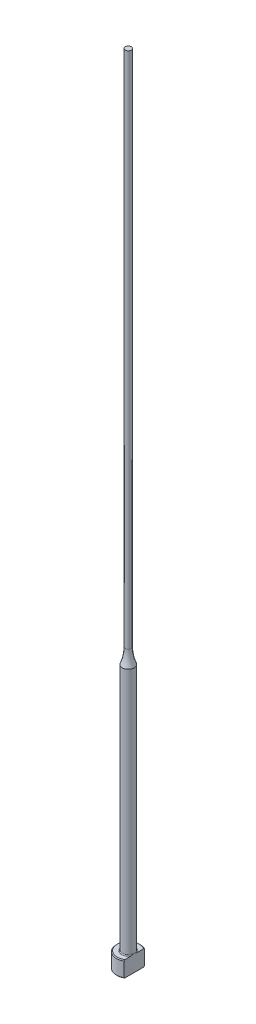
ISO-10303-21;
HEADER;
FILE_DESCRIPTION(('STEP AP214'),'2;1');
FILE_NAME('part.step','',(''),(''),'','','');
FILE_SCHEMA(('AUTOMOTIVE_DESIGN { 1 0 10303 214 1 1 1 1 }'));
ENDSEC;
DATA;
#1=APPLICATION_CONTEXT('core data for automotive mechanical design processes');
#2=APPLICATION_PROTOCOL_DEFINITION('international standard','automotive_design',2000,#1);
#3=PRODUCT_CONTEXT('',#1,'mechanical');
#4=PRODUCT('Part','Part','',(#3));
#5=PRODUCT_RELATED_PRODUCT_CATEGORY('part','',(#4));
#6=PRODUCT_DEFINITION_FORMATION('','',#4);
#7=PRODUCT_DEFINITION_CONTEXT('part definition',#1,'design');
#8=PRODUCT_DEFINITION('design','',#6,#7);
#9=PRODUCT_DEFINITION_SHAPE('','',#8);
#10=(LENGTH_UNIT() NAMED_UNIT(*) SI_UNIT(.MILLI.,.METRE.));
#11=(NAMED_UNIT(*) PLANE_ANGLE_UNIT() SI_UNIT($,.RADIAN.));
#12=(NAMED_UNIT(*) SI_UNIT($,.STERADIAN.) SOLID_ANGLE_UNIT());
#13=UNCERTAINTY_MEASURE_WITH_UNIT(LENGTH_MEASURE(1.E-05),#10,'distance_accuracy_value','');
#14=(GEOMETRIC_REPRESENTATION_CONTEXT(3) GLOBAL_UNCERTAINTY_ASSIGNED_CONTEXT((#13)) GLOBAL_UNIT_ASSIGNED_CONTEXT((#10,
#11,#12)) REPRESENTATION_CONTEXT('',''));
#15=CARTESIAN_POINT('',(0.,0.,0.));
#16=DIRECTION('',(0.,0.,1.));
#17=DIRECTION('',(1.,0.,0.));
#18=AXIS2_PLACEMENT_3D('',#15,#16,#17);
#19=CARTESIAN_POINT('',(-2.99999999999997,4.,0.));
#20=DIRECTION('',(0.,1.,0.));
#21=DIRECTION('',(0.,0.,1.));
#22=AXIS2_PLACEMENT_3D('',#19,#20,#21);
#23=PLANE('',#22);
#24=CARTESIAN_POINT('',(0.,4.,0.));
#25=DIRECTION('',(0.,1.,0.));
#26=DIRECTION('',(0.,0.,1.));
#27=AXIS2_PLACEMENT_3D('',#24,#25,#26);
#28=CIRCLE('',#27,2.79999999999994);
#29=CARTESIAN_POINT('',(1.49999999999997,4.,-2.36431808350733));
#30=VERTEX_POINT('',#29);
#31=CARTESIAN_POINT('',(1.49999999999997,4.,2.36431808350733));
#32=VERTEX_POINT('',#31);
#33=EDGE_CURVE('E187',#30,#32,#28,.T.);
#34=ORIENTED_EDGE('',*,*,#33,.T.);
#35=DIRECTION('',(0.,0.,-1.));
#36=VECTOR('',#35,1.);
#37=CARTESIAN_POINT('',(1.49999999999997,4.,0.));
#38=LINE('',#37,#36);
#39=CARTESIAN_POINT('',(1.49999999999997,3.99999999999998,0.799999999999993));
#40=VERTEX_POINT('',#39);
#41=EDGE_CURVE('E57',#32,#40,#38,.T.);
#42=ORIENTED_EDGE('',*,*,#41,.T.);
#43=CARTESIAN_POINT('',(0.,4.,0.));
#44=DIRECTION('',(0.,1.,0.));
#45=DIRECTION('',(0.,0.,1.));
#46=AXIS2_PLACEMENT_3D('',#43,#44,#45);
#47=CIRCLE('',#46,1.69999999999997);
#48=CARTESIAN_POINT('',(1.49999999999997,3.99999999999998,-0.799999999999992));
#49=VERTEX_POINT('',#48);
#50=EDGE_CURVE('E108',#40,#49,#47,.F.);
#51=ORIENTED_EDGE('',*,*,#50,.T.);
#52=EDGE_CURVE('E137',#49,#30,#38,.T.);
#53=ORIENTED_EDGE('',*,*,#52,.T.);
#54=EDGE_LOOP('',(#34,#42,#51,#53));
#55=FACE_BOUND('',#54,.T.);
#56=ADVANCED_FACE('F32',(#55),#23,.T.);
#57=CARTESIAN_POINT('',(0.,259.958771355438,0.));
#58=DIRECTION('',(0.,1.,0.));
#59=DIRECTION('',(0.,0.,1.));
#60=AXIS2_PLACEMENT_3D('',#57,#58,#59);
#61=CYLINDRICAL_SURFACE('',#60,2.99999999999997);
#62=CARTESIAN_POINT('',(0.,3.79999999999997,0.));
#63=DIRECTION('',(0.,1.,0.));
#64=DIRECTION('',(0.,0.,1.));
#65=AXIS2_PLACEMENT_3D('',#62,#63,#64);
#66=CIRCLE('',#65,2.99999999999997);
#67=CARTESIAN_POINT('',(1.49999999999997,3.79999999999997,2.5980762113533));
#68=VERTEX_POINT('',#67);
#69=CARTESIAN_POINT('',(1.49999999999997,3.79999999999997,-2.5980762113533));
#70=VERTEX_POINT('',#69);
#71=EDGE_CURVE('E105',#68,#70,#66,.F.);
#72=ORIENTED_EDGE('',*,*,#71,.T.);
#73=DIRECTION('',(0.,-1.,0.));
#74=VECTOR('',#73,1.);
#75=CARTESIAN_POINT('',(1.49999999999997,200.,-2.5980762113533));
#76=LINE('',#75,#74);
#77=CARTESIAN_POINT('',(1.49999999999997,0.200000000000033,-2.5980762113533));
#78=VERTEX_POINT('',#77);
#79=EDGE_CURVE('E193',#70,#78,#76,.T.);
#80=ORIENTED_EDGE('',*,*,#79,.T.);
#81=CARTESIAN_POINT('',(0.,0.200000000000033,0.));
#82=DIRECTION('',(0.,-1.,0.));
#83=DIRECTION('',(0.,0.,-1.));
#84=AXIS2_PLACEMENT_3D('',#81,#82,#83);
#85=CIRCLE('',#84,2.99999999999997);
#86=CARTESIAN_POINT('',(1.49999999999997,0.200000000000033,2.5980762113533));
#87=VERTEX_POINT('',#86);
#88=EDGE_CURVE('E100',#78,#87,#85,.F.);
#89=ORIENTED_EDGE('',*,*,#88,.T.);
#90=DIRECTION('',(0.,-1.,0.));
#91=VECTOR('',#90,1.);
#92=CARTESIAN_POINT('',(1.49999999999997,200.,2.5980762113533));
#93=LINE('',#92,#91);
#94=EDGE_CURVE('E93',#68,#87,#93,.T.);
#95=ORIENTED_EDGE('',*,*,#94,.F.);
#96=EDGE_LOOP('',(#72,#80,#89,#95));
#97=FACE_BOUND('',#96,.T.);
#98=ADVANCED_FACE('F158',(#97),#61,.T.);
#99=CARTESIAN_POINT('',(0.,0.,0.));
#100=DIRECTION('',(0.,-1.,0.));
#101=DIRECTION('',(0.,0.,-1.));
#102=AXIS2_PLACEMENT_3D('',#99,#100,#101);
#103=PLANE('',#102);
#104=CARTESIAN_POINT('',(0.,0.,0.));
#105=DIRECTION('',(0.,-1.,0.));
#106=DIRECTION('',(0.,0.,-1.));
#107=AXIS2_PLACEMENT_3D('',#104,#105,#106);
#108=CIRCLE('',#107,2.79999999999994);
#109=CARTESIAN_POINT('',(1.49999999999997,0.,2.36431808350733));
#110=VERTEX_POINT('',#109);
#111=CARTESIAN_POINT('',(1.49999999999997,0.,-2.36431808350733));
#112=VERTEX_POINT('',#111);
#113=EDGE_CURVE('E98',#110,#112,#108,.T.);
#114=ORIENTED_EDGE('',*,*,#113,.T.);
#115=DIRECTION('',(0.,0.,1.));
#116=VECTOR('',#115,1.);
#117=CARTESIAN_POINT('',(1.49999999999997,0.,2.5980762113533));
#118=LINE('',#117,#116);
#119=EDGE_CURVE('E83',#112,#110,#118,.T.);
#120=ORIENTED_EDGE('',*,*,#119,.T.);
#121=EDGE_LOOP('',(#114,#120));
#122=FACE_BOUND('',#121,.T.);
#123=ADVANCED_FACE('F103',(#122),#103,.T.);
#124=CARTESIAN_POINT('',(0.,4.,0.));
#125=DIRECTION('',(0.,-1.,0.));
#126=DIRECTION('',(0.,0.,-1.));
#127=AXIS2_PLACEMENT_3D('',#124,#125,#126);
#128=CONICAL_SURFACE('',#127,2.79999999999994,0.785398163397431);
#129=ORIENTED_EDGE('',*,*,#71,.F.);
#130=CARTESIAN_POINT('',(1.49999999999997,0.888258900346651,5.71827621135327));
#131=CARTESIAN_POINT('',(1.49999999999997,1.01361833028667,5.58866816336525));
#132=CARTESIAN_POINT('',(1.49999999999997,1.13884324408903,5.45892957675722));
#133=CARTESIAN_POINT('',(1.49999999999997,1.38894444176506,5.19911365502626));
#134=CARTESIAN_POINT('',(1.49999999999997,1.51382072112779,5.06903631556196));
#135=CARTESIAN_POINT('',(1.49999999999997,1.76320568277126,4.80840180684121));
#136=CARTESIAN_POINT('',(1.49999999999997,1.88771414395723,4.67784442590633));
#137=CARTESIAN_POINT('',(1.49999999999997,2.13618059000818,4.4162081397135));
#138=CARTESIAN_POINT('',(1.49999999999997,2.26013857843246,4.28512923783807));
#139=CARTESIAN_POINT('',(1.49999999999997,2.50488975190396,4.02490837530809));
#140=CARTESIAN_POINT('',(1.49999999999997,2.62569693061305,3.8957795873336));
#141=CARTESIAN_POINT('',(1.49999999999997,2.86640694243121,3.63668213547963));
#142=CARTESIAN_POINT('',(1.49999999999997,2.98630978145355,3.50671347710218));
#143=CARTESIAN_POINT('',(1.49999999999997,3.22486033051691,3.24567921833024));
#144=CARTESIAN_POINT('',(1.49999999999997,3.3435083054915,3.11461386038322));
#145=CARTESIAN_POINT('',(1.49999999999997,3.5790771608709,2.85094268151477));
#146=CARTESIAN_POINT('',(1.49999999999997,3.69599811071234,2.71833692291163));
#147=CARTESIAN_POINT('',(1.49999999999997,3.88262371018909,2.50255231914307));
#148=CARTESIAN_POINT('',(1.49999999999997,3.95312454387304,2.42006293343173));
#149=CARTESIAN_POINT('',(1.49999999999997,4.09287098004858,2.254010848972));
#150=CARTESIAN_POINT('',(1.49999999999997,4.16211645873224,2.17044804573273));
#151=CARTESIAN_POINT('',(1.49999999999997,4.29964684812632,2.00105967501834));
#152=CARTESIAN_POINT('',(1.49999999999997,4.36791386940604,1.9152195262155));
#153=CARTESIAN_POINT('',(1.49999999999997,4.50205840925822,1.7417139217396));
#154=CARTESIAN_POINT('',(1.49999999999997,4.56793649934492,1.65404891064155));
#155=CARTESIAN_POINT('',(1.49999999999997,4.69728151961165,1.47490236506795));
#156=CARTESIAN_POINT('',(1.49999999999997,4.76069661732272,1.38338308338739));
#157=CARTESIAN_POINT('',(1.49999999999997,4.88239539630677,1.19675661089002));
#158=CARTESIAN_POINT('',(1.49999999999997,4.94067201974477,1.10164473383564));
#159=CARTESIAN_POINT('',(1.49999999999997,5.048413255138,0.908008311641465));
#160=CARTESIAN_POINT('',(1.49999999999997,5.09797809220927,0.809540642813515));
#161=CARTESIAN_POINT('',(1.49999999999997,5.18432188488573,0.607192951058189));
#162=CARTESIAN_POINT('',(1.49999999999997,5.22114374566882,0.50333247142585));
#163=CARTESIAN_POINT('',(1.49999999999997,5.26099935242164,0.347577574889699));
#164=CARTESIAN_POINT('',(1.49999999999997,5.2715702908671,0.297609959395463));
#165=CARTESIAN_POINT('',(1.49999999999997,5.28794860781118,0.196885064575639));
#166=CARTESIAN_POINT('',(1.49999999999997,5.29375640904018,0.146127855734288));
#167=CARTESIAN_POINT('',(1.49999999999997,5.30019707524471,0.0444388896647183));
#168=CARTESIAN_POINT('',(1.49999999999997,5.30084594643,-0.00649183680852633));
#169=CARTESIAN_POINT('',(1.49999999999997,5.29696416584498,-0.108155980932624));
#170=CARTESIAN_POINT('',(1.49999999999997,5.29243308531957,-0.158889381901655));
#171=CARTESIAN_POINT('',(1.49999999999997,5.27856915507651,-0.259234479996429));
#172=CARTESIAN_POINT('',(1.49999999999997,5.2692782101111,-0.308852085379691));
#173=CARTESIAN_POINT('',(1.49999999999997,5.24647108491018,-0.407110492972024));
#174=CARTESIAN_POINT('',(1.49999999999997,5.23295324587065,-0.45575090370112));
#175=CARTESIAN_POINT('',(1.49999999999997,5.20226175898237,-0.55214996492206));
#176=CARTESIAN_POINT('',(1.49999999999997,5.18506801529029,-0.599902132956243));
#177=CARTESIAN_POINT('',(1.49999999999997,5.1477138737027,-0.694205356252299));
#178=CARTESIAN_POINT('',(1.49999999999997,5.12755408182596,-0.740756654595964));
#179=CARTESIAN_POINT('',(1.49999999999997,5.0632769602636,-0.879166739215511));
#180=CARTESIAN_POINT('',(1.49999999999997,5.01551721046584,-0.969329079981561));
#181=CARTESIAN_POINT('',(1.49999999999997,4.91367909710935,-1.14604316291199));
#182=CARTESIAN_POINT('',(1.49999999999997,4.85959300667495,-1.2325903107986));
#183=CARTESIAN_POINT('',(1.49999999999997,4.74697968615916,-1.40321348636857));
#184=CARTESIAN_POINT('',(1.49999999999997,4.68843573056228,-1.4872783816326));
#185=CARTESIAN_POINT('',(1.49999999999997,4.5684384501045,-1.65322187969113));
#186=CARTESIAN_POINT('',(1.49999999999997,4.50698656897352,-1.73510153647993));
#187=CARTESIAN_POINT('',(1.49999999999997,4.3811567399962,-1.89829823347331));
#188=CARTESIAN_POINT('',(1.49999999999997,4.31675092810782,-1.97959369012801));
#189=CARTESIAN_POINT('',(1.49999999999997,4.18634068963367,-2.14090082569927));
#190=CARTESIAN_POINT('',(1.49999999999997,4.12033609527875,-2.22091236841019));
#191=CARTESIAN_POINT('',(1.49999999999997,3.92086431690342,-2.45906508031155));
#192=CARTESIAN_POINT('',(1.49999999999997,3.78562663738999,-2.61572090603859));
#193=CARTESIAN_POINT('',(1.49999999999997,3.53554498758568,-2.90006295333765));
#194=CARTESIAN_POINT('',(1.49999999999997,3.42114543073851,-3.02814382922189));
#195=CARTESIAN_POINT('',(1.49999999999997,3.1909355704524,-3.28303767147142));
#196=CARTESIAN_POINT('',(1.49999999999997,3.07512522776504,-3.40985060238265));
#197=CARTESIAN_POINT('',(1.49999999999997,2.72597067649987,-3.78913849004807));
#198=CARTESIAN_POINT('',(1.49999999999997,2.49111760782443,-4.04022177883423));
#199=CARTESIAN_POINT('',(1.49999999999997,2.0288247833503,-4.52992803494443));
#200=CARTESIAN_POINT('',(1.49999999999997,1.80147747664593,-4.7686387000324));
#201=CARTESIAN_POINT('',(1.49999999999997,1.45954865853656,-5.12558036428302));
#202=CARTESIAN_POINT('',(1.49999999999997,1.34548484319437,-5.24430773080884));
#203=CARTESIAN_POINT('',(1.49999999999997,1.11707176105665,-5.48148573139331));
#204=CARTESIAN_POINT('',(1.49999999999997,1.00272249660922,-5.59993636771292));
#205=CARTESIAN_POINT('',(1.49999999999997,0.888258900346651,-5.71827621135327));
#206=B_SPLINE_CURVE_WITH_KNOTS('',3,(#130,#131,#132,#133,#134,#135,#136,#137,#138,#139,#140,
#141,#142,#143,#144,#145,#146,#147,#148,#149,#150,#151,#152,#153,#154,#155,#156,#157,#158,#159,
#160,#161,#162,#163,#164,#165,#166,#167,#168,#169,#170,#171,#172,#173,#174,#175,#176,#177,#178,
#179,#180,#181,#182,#183,#184,#185,#186,#187,#188,#189,#190,#191,#192,#193,#194,#195,#196,#197,
#198,#199,#200,#201,#202,#203,#204,#205),.UNSPECIFIED.,.F.,.F.,(4,2,2,2,2,2,2,2,2,2,2,2,2,2,2,2,
2,2,2,2,2,2,2,2,2,2,2,2,2,2,2,2,2,2,2,2,2,4),(0.,0.540943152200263,1.08189327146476,
1.62312052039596,2.16434426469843,2.69482920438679,3.22531067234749,3.75567781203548,
4.28602356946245,4.611550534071,4.9371094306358,5.26610945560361,5.59503024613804,
5.92894782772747,6.26331713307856,6.59354403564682,6.92264800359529,7.07567478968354,
7.22868799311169,7.38122626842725,7.53377717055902,7.68500755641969,7.83629736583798,
7.988436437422,8.14054446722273,8.44618799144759,8.75220879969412,9.05944044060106,
9.36652111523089,9.6776428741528,9.98879742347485,10.609592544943,11.1247803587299,
11.6399825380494,12.6713544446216,13.6603005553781,14.1542238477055,14.6481430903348),.UNSPECIFIED.);
#207=EDGE_CURVE('E136',#68,#32,#206,.T.);
#208=ORIENTED_EDGE('',*,*,#207,.T.);
#209=ORIENTED_EDGE('',*,*,#33,.F.);
#210=EDGE_CURVE('E128',#30,#70,#206,.T.);
#211=ORIENTED_EDGE('',*,*,#210,.T.);
#212=EDGE_LOOP('',(#129,#208,#209,#211));
#213=FACE_BOUND('',#212,.T.);
#214=ADVANCED_FACE('F144',(#213),#128,.T.);
#215=CARTESIAN_POINT('',(0.,0.200000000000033,0.));
#216=DIRECTION('',(0.,1.,0.));
#217=DIRECTION('',(0.,0.,1.));
#218=AXIS2_PLACEMENT_3D('',#215,#216,#217);
#219=CONICAL_SURFACE('',#218,2.99999999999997,0.785398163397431);
#220=ORIENTED_EDGE('',*,*,#88,.F.);
#221=CARTESIAN_POINT('',(1.49999999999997,3.11174109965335,-5.71827621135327));
#222=CARTESIAN_POINT('',(1.49999999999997,2.98638166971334,-5.58866816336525));
#223=CARTESIAN_POINT('',(1.49999999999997,2.86115675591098,-5.45892957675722));
#224=CARTESIAN_POINT('',(1.49999999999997,2.61105555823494,-5.19911365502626));
#225=CARTESIAN_POINT('',(1.49999999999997,2.48617927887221,-5.06903631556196));
#226=CARTESIAN_POINT('',(1.49999999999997,2.23679431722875,-4.80840180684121));
#227=CARTESIAN_POINT('',(1.49999999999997,2.11228585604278,-4.67784442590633));
#228=CARTESIAN_POINT('',(1.49999999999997,1.86381940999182,-4.4162081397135));
#229=CARTESIAN_POINT('',(1.49999999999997,1.73986142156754,-4.28512923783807));
#230=CARTESIAN_POINT('',(1.49999999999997,1.49511024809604,-4.02490837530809));
#231=CARTESIAN_POINT('',(1.49999999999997,1.37430306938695,-3.8957795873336));
#232=CARTESIAN_POINT('',(1.49999999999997,1.13359305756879,-3.63668213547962));
#233=CARTESIAN_POINT('',(1.49999999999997,1.01369021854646,-3.50671347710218));
#234=CARTESIAN_POINT('',(1.49999999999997,0.775139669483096,-3.24567921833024));
#235=CARTESIAN_POINT('',(1.49999999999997,0.656491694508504,-3.11461386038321));
#236=CARTESIAN_POINT('',(1.49999999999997,0.420922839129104,-2.85094268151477));
#237=CARTESIAN_POINT('',(1.49999999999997,0.304001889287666,-2.71833692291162));
#238=CARTESIAN_POINT('',(1.49999999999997,0.117376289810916,-2.50255231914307));
#239=CARTESIAN_POINT('',(1.49999999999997,0.0468754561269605,-2.42006293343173));
#240=CARTESIAN_POINT('',(1.49999999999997,-0.0928709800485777,-2.254010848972));
#241=CARTESIAN_POINT('',(1.49999999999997,-0.162116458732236,-2.17044804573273));
#242=CARTESIAN_POINT('',(1.49999999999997,-0.299646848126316,-2.00105967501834));
#243=CARTESIAN_POINT('',(1.49999999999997,-0.367913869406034,-1.9152195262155));
#244=CARTESIAN_POINT('',(1.49999999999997,-0.502058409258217,-1.7417139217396));
#245=CARTESIAN_POINT('',(1.49999999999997,-0.567936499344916,-1.65404891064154));
#246=CARTESIAN_POINT('',(1.49999999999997,-0.697281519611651,-1.47490236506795));
#247=CARTESIAN_POINT('',(1.49999999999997,-0.760696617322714,-1.38338308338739));
#248=CARTESIAN_POINT('',(1.49999999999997,-0.882395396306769,-1.19675661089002));
#249=CARTESIAN_POINT('',(1.49999999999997,-0.940672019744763,-1.10164473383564));
#250=CARTESIAN_POINT('',(1.49999999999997,-1.048413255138,-0.908008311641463));
#251=CARTESIAN_POINT('',(1.49999999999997,-1.09797809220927,-0.809540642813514));
#252=CARTESIAN_POINT('',(1.49999999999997,-1.18432188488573,-0.607192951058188));
#253=CARTESIAN_POINT('',(1.49999999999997,-1.22114374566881,-0.503332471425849));
#254=CARTESIAN_POINT('',(1.49999999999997,-1.26099935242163,-0.347577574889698));
#255=CARTESIAN_POINT('',(1.49999999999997,-1.2715702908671,-0.297609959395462));
#256=CARTESIAN_POINT('',(1.49999999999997,-1.28794860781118,-0.196885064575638));
#257=CARTESIAN_POINT('',(1.49999999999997,-1.29375640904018,-0.146127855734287));
#258=CARTESIAN_POINT('',(1.49999999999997,-1.30019707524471,-0.0444388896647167));
#259=CARTESIAN_POINT('',(1.49999999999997,-1.30084594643,0.00649183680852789));
#260=CARTESIAN_POINT('',(1.49999999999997,-1.29696416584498,0.108155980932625));
#261=CARTESIAN_POINT('',(1.49999999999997,-1.29243308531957,0.158889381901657));
#262=CARTESIAN_POINT('',(1.49999999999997,-1.2785691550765,0.259234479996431));
#263=CARTESIAN_POINT('',(1.49999999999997,-1.2692782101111,0.308852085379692));
#264=CARTESIAN_POINT('',(1.49999999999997,-1.24647108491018,0.407110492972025));
#265=CARTESIAN_POINT('',(1.49999999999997,-1.23295324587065,0.455750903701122));
#266=CARTESIAN_POINT('',(1.49999999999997,-1.20226175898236,0.552149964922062));
#267=CARTESIAN_POINT('',(1.49999999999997,-1.18506801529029,0.599902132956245));
#268=CARTESIAN_POINT('',(1.49999999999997,-1.14771387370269,0.694205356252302));
#269=CARTESIAN_POINT('',(1.49999999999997,-1.12755408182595,0.740756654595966));
#270=CARTESIAN_POINT('',(1.49999999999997,-1.0632769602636,0.879166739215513));
#271=CARTESIAN_POINT('',(1.49999999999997,-1.01551721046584,0.969329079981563));
#272=CARTESIAN_POINT('',(1.49999999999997,-0.913679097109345,1.14604316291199));
#273=CARTESIAN_POINT('',(1.49999999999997,-0.859593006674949,1.2325903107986));
#274=CARTESIAN_POINT('',(1.49999999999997,-0.746979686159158,1.40321348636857));
#275=CARTESIAN_POINT('',(1.49999999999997,-0.688435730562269,1.4872783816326));
#276=CARTESIAN_POINT('',(1.49999999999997,-0.568438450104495,1.65322187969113));
#277=CARTESIAN_POINT('',(1.49999999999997,-0.506986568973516,1.73510153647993));
#278=CARTESIAN_POINT('',(1.49999999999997,-0.381156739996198,1.89829823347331));
#279=CARTESIAN_POINT('',(1.49999999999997,-0.316750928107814,1.97959369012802));
#280=CARTESIAN_POINT('',(1.49999999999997,-0.186340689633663,2.14090082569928));
#281=CARTESIAN_POINT('',(1.49999999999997,-0.12033609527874,2.22091236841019));
#282=CARTESIAN_POINT('',(1.49999999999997,0.0791356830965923,2.45906508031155));
#283=CARTESIAN_POINT('',(1.49999999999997,0.214373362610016,2.61572090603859));
#284=CARTESIAN_POINT('',(1.49999999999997,0.46445501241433,2.90006295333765));
#285=CARTESIAN_POINT('',(1.49999999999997,0.578854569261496,3.02814382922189));
#286=CARTESIAN_POINT('',(1.49999999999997,0.809064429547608,3.28303767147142));
#287=CARTESIAN_POINT('',(1.49999999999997,0.924874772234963,3.40985060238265));
#288=CARTESIAN_POINT('',(1.49999999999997,1.27402932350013,3.78913849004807));
#289=CARTESIAN_POINT('',(1.49999999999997,1.50888239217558,4.04022177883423));
#290=CARTESIAN_POINT('',(1.49999999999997,1.97117521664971,4.52992803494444));
#291=CARTESIAN_POINT('',(1.49999999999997,2.19852252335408,4.76863870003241));
#292=CARTESIAN_POINT('',(1.49999999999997,2.54045134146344,5.12558036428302));
#293=CARTESIAN_POINT('',(1.49999999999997,2.65451515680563,5.24430773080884));
#294=CARTESIAN_POINT('',(1.49999999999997,2.88292823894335,5.48148573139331));
#295=CARTESIAN_POINT('',(1.49999999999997,2.99727750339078,5.59993636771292));
#296=CARTESIAN_POINT('',(1.49999999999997,3.11174109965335,5.71827621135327));
#297=B_SPLINE_CURVE_WITH_KNOTS('',3,(#221,#222,#223,#224,#225,#226,#227,#228,#229,#230,#231,
#232,#233,#234,#235,#236,#237,#238,#239,#240,#241,#242,#243,#244,#245,#246,#247,#248,#249,#250,
#251,#252,#253,#254,#255,#256,#257,#258,#259,#260,#261,#262,#263,#264,#265,#266,#267,#268,#269,
#270,#271,#272,#273,#274,#275,#276,#277,#278,#279,#280,#281,#282,#283,#284,#285,#286,#287,#288,
#289,#290,#291,#292,#293,#294,#295,#296),.UNSPECIFIED.,.F.,.F.,(4,2,2,2,2,2,2,2,2,2,2,2,2,2,2,2,
2,2,2,2,2,2,2,2,2,2,2,2,2,2,2,2,2,2,2,2,2,4),(0.,0.540943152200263,1.08189327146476,
1.62312052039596,2.16434426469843,2.69482920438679,3.22531067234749,3.75567781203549,
4.28602356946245,4.611550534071,4.9371094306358,5.26610945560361,5.59503024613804,
5.92894782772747,6.26331713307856,6.59354403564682,6.92264800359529,7.07567478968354,
7.2286879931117,7.38122626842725,7.53377717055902,7.6850075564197,7.83629736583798,
7.98843643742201,8.14054446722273,8.44618799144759,8.75220879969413,9.05944044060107,
9.3665211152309,9.6776428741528,9.98879742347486,10.609592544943,11.1247803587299,
11.6399825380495,12.6713544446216,13.6603005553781,14.1542238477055,14.6481430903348),.UNSPECIFIED.);
#298=EDGE_CURVE('E86',#78,#112,#297,.T.);
#299=ORIENTED_EDGE('',*,*,#298,.T.);
#300=ORIENTED_EDGE('',*,*,#113,.F.);
#301=EDGE_CURVE('E89',#110,#87,#297,.T.);
#302=ORIENTED_EDGE('',*,*,#301,.T.);
#303=EDGE_LOOP('',(#220,#299,#300,#302));
#304=FACE_BOUND('',#303,.T.);
#305=ADVANCED_FACE('F97',(#304),#219,.T.);
#306=CARTESIAN_POINT('',(0.,4.19999999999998,0.));
#307=DIRECTION('',(0.,1.,0.));
#308=DIRECTION('',(0.,0.,1.));
#309=AXIS2_PLACEMENT_3D('',#306,#307,#308);
#310=TOROIDAL_SURFACE('',#309,1.69999999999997,0.2);
#311=CARTESIAN_POINT('',(1.49999999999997,4.19999999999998,0.));
#312=CARTESIAN_POINT('',(1.49999999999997,4.20000050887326,7.14686674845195E-11));
#313=CARTESIAN_POINT('',(1.49999999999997,4.20000101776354,-1.21663673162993E-07));
#314=CARTESIAN_POINT('',(1.49999999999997,4.20000199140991,-4.97616237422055E-07));
#315=CARTESIAN_POINT('',(1.49999999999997,4.20000245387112,-7.56516220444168E-07));
#316=CARTESIAN_POINT('',(1.49999999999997,4.20000338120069,-1.37642837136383E-06));
#317=CARTESIAN_POINT('',(1.49999999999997,4.20000384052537,-1.74563476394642E-06));
#318=CARTESIAN_POINT('',(1.49999999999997,4.20000469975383,-2.53565984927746E-06));
#319=CARTESIAN_POINT('',(1.49999999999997,4.20000510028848,-2.95582597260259E-06));
#320=CARTESIAN_POINT('',(1.49999999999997,4.20000646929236,-4.48430445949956E-06));
#321=CARTESIAN_POINT('',(1.49999999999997,4.20000736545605,-5.6586103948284E-06));
#322=CARTESIAN_POINT('',(1.49999999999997,4.20000893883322,-8.06479202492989E-06));
#323=CARTESIAN_POINT('',(1.49999999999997,4.20000962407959,-9.29170517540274E-06));
#324=CARTESIAN_POINT('',(1.49999999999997,4.20001225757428,-1.416232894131E-05));
#325=CARTESIAN_POINT('',(1.49999999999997,4.20001407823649,-1.78790031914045E-05));
#326=CARTESIAN_POINT('',(1.49999999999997,4.20001699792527,-2.51443066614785E-05));
#327=CARTESIAN_POINT('',(1.49999999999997,4.20001815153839,-2.86715394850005E-05));
#328=CARTESIAN_POINT('',(1.49999999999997,4.20002315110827,-4.39218128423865E-05));
#329=CARTESIAN_POINT('',(1.49999999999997,4.20002701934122,-5.56288390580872E-05));
#330=CARTESIAN_POINT('',(1.49999999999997,4.20003312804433,-7.7405829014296E-05));
#331=CARTESIAN_POINT('',(1.49999999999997,4.20003553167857,-8.74278412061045E-05));
#332=CARTESIAN_POINT('',(1.49999999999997,4.20005483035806,-0.000161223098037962));
#333=CARTESIAN_POINT('',(1.49999999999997,4.20007979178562,-0.000222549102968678));
#334=CARTESIAN_POINT('',(1.49999999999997,4.20017391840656,-0.000462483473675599));
#335=CARTESIAN_POINT('',(1.49999999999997,4.20023706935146,-0.000642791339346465));
#336=CARTESIAN_POINT('',(1.49999999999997,4.20048761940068,-0.00134785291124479));
#337=CARTESIAN_POINT('',(1.49999999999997,4.20068132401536,-0.00187087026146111));
#338=CARTESIAN_POINT('',(1.49999999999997,4.20147357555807,-0.00402004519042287));
#339=CARTESIAN_POINT('',(1.49999999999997,4.20206499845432,-0.0056481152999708));
#340=CARTESIAN_POINT('',(1.49999999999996,4.20892634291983,-0.0245232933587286));
#341=CARTESIAN_POINT('',(1.49999999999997,4.21523683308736,-0.041759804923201));
#342=CARTESIAN_POINT('',(1.49999999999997,4.22755028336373,-0.0756091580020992));
#343=CARTESIAN_POINT('',(1.49999999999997,4.23355589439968,-0.0922211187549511));
#344=CARTESIAN_POINT('',(1.49999999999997,4.24620101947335,-0.127454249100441));
#345=CARTESIAN_POINT('',(1.49999999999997,4.25283080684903,-0.146078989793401));
#346=CARTESIAN_POINT('',(1.49999999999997,4.26599765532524,-0.183577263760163));
#347=CARTESIAN_POINT('',(1.49999999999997,4.27253305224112,-0.202451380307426));
#348=CARTESIAN_POINT('',(1.49999999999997,4.28834228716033,-0.248982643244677));
#349=CARTESIAN_POINT('',(1.49999999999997,4.2974915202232,-0.276682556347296));
#350=CARTESIAN_POINT('',(1.49999999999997,4.31490935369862,-0.331625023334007));
#351=CARTESIAN_POINT('',(1.49999999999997,4.3231938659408,-0.358862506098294));
#352=CARTESIAN_POINT('',(1.49999999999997,4.34051594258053,-0.419125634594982));
#353=CARTESIAN_POINT('',(1.49999999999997,4.34936607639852,-0.452206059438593));
#354=CARTESIAN_POINT('',(1.49999999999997,4.36549583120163,-0.519023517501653));
#355=CARTESIAN_POINT('',(1.49999999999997,4.37276283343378,-0.552763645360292));
#356=CARTESIAN_POINT('',(1.49999999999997,4.38554755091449,-0.62305310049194));
#357=CARTESIAN_POINT('',(1.49999999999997,4.39090573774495,-0.65963271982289));
#358=CARTESIAN_POINT('',(1.49999999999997,4.39825016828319,-0.733028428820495));
#359=CARTESIAN_POINT('',(1.49999999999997,4.40024734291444,-0.76984335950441));
#360=CARTESIAN_POINT('',(1.49999999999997,4.39970780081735,-0.842856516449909));
#361=CARTESIAN_POINT('',(1.49999999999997,4.39725347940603,-0.879053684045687));
#362=CARTESIAN_POINT('',(1.49999999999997,4.38900085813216,-0.93238076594));
#363=CARTESIAN_POINT('',(1.49999999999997,4.38553049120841,-0.949868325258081));
#364=CARTESIAN_POINT('',(1.49999999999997,4.37678336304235,-0.984374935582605));
#365=CARTESIAN_POINT('',(1.49999999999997,4.37150943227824,-1.00139467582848));
#366=CARTESIAN_POINT('',(1.49999999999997,4.35869781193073,-1.03479423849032));
#367=CARTESIAN_POINT('',(1.49999999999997,4.3511359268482,-1.05116499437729));
#368=CARTESIAN_POINT('',(1.49999999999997,4.33325333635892,-1.08234828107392));
#369=CARTESIAN_POINT('',(1.49999999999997,4.32294266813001,-1.09716621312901));
#370=CARTESIAN_POINT('',(1.49999999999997,4.30512758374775,-1.11714173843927));
#371=CARTESIAN_POINT('',(1.49999999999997,4.29884721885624,-1.12339066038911));
#372=CARTESIAN_POINT('',(1.49999999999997,4.28545950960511,-1.13494695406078));
#373=CARTESIAN_POINT('',(1.49999999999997,4.27835226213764,-1.14025443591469));
#374=CARTESIAN_POINT('',(1.49999999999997,4.26325970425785,-1.14967631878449));
#375=CARTESIAN_POINT('',(1.49999999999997,4.25526534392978,-1.15377649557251));
#376=CARTESIAN_POINT('',(1.49999999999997,4.23863207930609,-1.16034952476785));
#377=CARTESIAN_POINT('',(1.49999999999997,4.22999427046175,-1.16282507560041));
#378=CARTESIAN_POINT('',(1.49999999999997,4.21343922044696,-1.16570267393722));
#379=CARTESIAN_POINT('',(1.49999999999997,4.20555896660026,-1.16631687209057));
#380=CARTESIAN_POINT('',(1.49999999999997,4.18982775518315,-1.16602054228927));
#381=CARTESIAN_POINT('',(1.49999999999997,4.18197679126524,-1.16511036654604));
#382=CARTESIAN_POINT('',(1.49999999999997,4.16747846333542,-1.16204446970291));
#383=CARTESIAN_POINT('',(1.49999999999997,4.16079696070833,-1.16004509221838));
#384=CARTESIAN_POINT('',(1.49999999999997,4.14781700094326,-1.15505972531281));
#385=CARTESIAN_POINT('',(1.49999999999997,4.14151862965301,-1.1520735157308));
#386=CARTESIAN_POINT('',(1.49999999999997,4.12690214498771,-1.14387585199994));
#387=CARTESIAN_POINT('',(1.49999999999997,4.11881436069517,-1.13825400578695));
#388=CARTESIAN_POINT('',(1.49999999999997,4.1036444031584,-1.12578441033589));
#389=CARTESIAN_POINT('',(1.49999999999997,4.09656475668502,-1.11893367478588));
#390=CARTESIAN_POINT('',(1.49999999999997,4.08012297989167,-1.10074342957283));
#391=CARTESIAN_POINT('',(1.49999999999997,4.07136543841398,-1.08886044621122));
#392=CARTESIAN_POINT('',(1.49999999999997,4.05578194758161,-1.06392743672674));
#393=CARTESIAN_POINT('',(1.49999999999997,4.0489571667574,-1.05087671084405));
#394=CARTESIAN_POINT('',(1.49999999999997,4.03273856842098,-1.01472307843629));
#395=CARTESIAN_POINT('',(1.49999999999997,4.02486230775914,-0.990945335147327));
#396=CARTESIAN_POINT('',(1.49999999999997,4.01257693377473,-0.94232199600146));
#397=CARTESIAN_POINT('',(1.49999999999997,4.00820590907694,-0.917467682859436));
#398=CARTESIAN_POINT('',(1.49999999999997,4.00229956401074,-0.867912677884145));
#399=CARTESIAN_POINT('',(1.49999999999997,4.0007128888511,-0.843217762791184));
#400=CARTESIAN_POINT('',(1.49999999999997,3.9996723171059,-0.79374605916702));
#401=CARTESIAN_POINT('',(1.49999999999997,4.0002230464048,-0.768969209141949));
#402=CARTESIAN_POINT('',(1.49999999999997,4.00433101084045,-0.696994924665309));
#403=CARTESIAN_POINT('',(1.49999999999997,4.01016976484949,-0.64993124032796));
#404=CARTESIAN_POINT('',(1.49999999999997,4.02567776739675,-0.559166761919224));
#405=CARTESIAN_POINT('',(1.49999999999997,4.03511950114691,-0.515423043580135));
#406=CARTESIAN_POINT('',(1.49999999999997,4.05693059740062,-0.427590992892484));
#407=CARTESIAN_POINT('',(1.49999999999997,4.06936356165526,-0.383518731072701));
#408=CARTESIAN_POINT('',(1.49999999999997,4.09174953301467,-0.310161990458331));
#409=CARTESIAN_POINT('',(1.49999999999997,4.10119843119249,-0.280718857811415));
#410=CARTESIAN_POINT('',(1.49999999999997,4.12060442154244,-0.22234098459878));
#411=CARTESIAN_POINT('',(1.49999999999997,4.13055519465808,-0.193404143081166));
#412=CARTESIAN_POINT('',(1.49999999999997,4.14973721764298,-0.138756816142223));
#413=CARTESIAN_POINT('',(1.49999999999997,4.15893123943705,-0.113033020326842));
#414=CARTESIAN_POINT('',(1.49999999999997,4.17788037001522,-0.0606351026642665));
#415=CARTESIAN_POINT('',(1.49999999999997,4.18764328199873,-0.0339636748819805));
#416=CARTESIAN_POINT('',(1.49999999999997,4.19793548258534,-0.00564657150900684));
#417=CARTESIAN_POINT('',(1.49999999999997,4.19852751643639,-0.00401699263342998));
#418=CARTESIAN_POINT('',(1.49999999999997,4.1993199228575,-0.0018674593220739));
#419=CARTESIAN_POINT('',(1.49999999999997,4.19951319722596,-0.00134559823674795));
#420=CARTESIAN_POINT('',(1.49999999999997,4.19976322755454,-0.000641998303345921));
#421=CARTESIAN_POINT('',(1.49999999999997,4.19982627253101,-0.000461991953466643));
#422=CARTESIAN_POINT('',(1.49999999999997,4.19992025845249,-0.000222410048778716));
#423=CARTESIAN_POINT('',(1.49999999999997,4.19994519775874,-0.000161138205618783));
#424=CARTESIAN_POINT('',(1.49999999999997,4.19996448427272,-8.74039267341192E-05));
#425=CARTESIAN_POINT('',(1.49999999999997,4.19996688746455,-7.73857556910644E-05));
#426=CARTESIAN_POINT('',(1.49999999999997,4.1999729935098,-5.56173272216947E-05));
#427=CARTESIAN_POINT('',(1.49999999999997,4.19997685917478,-4.39149186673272E-05));
#428=CARTESIAN_POINT('',(1.49999999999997,4.19998185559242,-2.86698156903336E-05));
#429=CARTESIAN_POINT('',(1.49999999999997,4.19998300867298,-2.51431575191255E-05));
#430=CARTESIAN_POINT('',(1.49999999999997,4.19998592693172,-1.78789552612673E-05));
#431=CARTESIAN_POINT('',(1.49999999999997,4.19998774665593,-1.41627846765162E-05));
#432=CARTESIAN_POINT('',(1.49999999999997,4.19999037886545,-9.29264488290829E-06));
#433=CARTESIAN_POINT('',(1.49999999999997,4.19999106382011,-8.06577599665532E-06));
#434=CARTESIAN_POINT('',(1.49999999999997,4.19999263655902,-5.65962639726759E-06));
#435=CARTESIAN_POINT('',(1.49999999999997,4.19999353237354,-4.48530466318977E-06));
#436=CARTESIAN_POINT('',(1.49999999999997,4.19999490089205,-2.95673740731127E-06));
#437=CARTESIAN_POINT('',(1.49999999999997,4.1999953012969,-2.53653208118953E-06));
#438=CARTESIAN_POINT('',(1.49999999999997,4.19999616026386,-1.74640525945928E-06));
#439=CARTESIAN_POINT('',(1.49999999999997,4.19999661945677,-1.37713598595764E-06));
#440=CARTESIAN_POINT('',(1.49999999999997,4.19999754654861,-7.57072336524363E-07));
#441=CARTESIAN_POINT('',(1.49999999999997,4.19999800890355,-4.9808738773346E-07));
#442=CARTESIAN_POINT('',(1.49999999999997,4.19999898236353,-1.21927249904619E-07));
#443=CARTESIAN_POINT('',(1.49999999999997,4.19999949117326,-7.14621294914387E-11));
#444=CARTESIAN_POINT('',(1.49999999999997,4.19999999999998,0.));
#445=B_SPLINE_CURVE_WITH_KNOTS('',3,(#311,#312,#313,#314,#315,#316,#317,#318,#319,#320,#321,
#322,#323,#324,#325,#326,#327,#328,#329,#330,#331,#332,#333,#334,#335,#336,#337,#338,#339,#340,
#341,#342,#343,#344,#345,#346,#347,#348,#349,#350,#351,#352,#353,#354,#355,#356,#357,#358,#359,
#360,#361,#362,#363,#364,#365,#366,#367,#368,#369,#370,#371,#372,#373,#374,#375,#376,#377,#378,
#379,#380,#381,#382,#383,#384,#385,#386,#387,#388,#389,#390,#391,#392,#393,#394,#395,#396,#397,
#398,#399,#400,#401,#402,#403,#404,#405,#406,#407,#408,#409,#410,#411,#412,#413,#414,#415,#416,
#417,#418,#419,#420,#421,#422,#423,#424,#425,#426,#427,#428,#429,#430,#431,#432,#433,#434,#435,
#436,#437,#438,#439,#440,#441,#442,#443,#444),.UNSPECIFIED.,.T.,.F.,(4,2,2,2,2,2,2,2,2,2,2,2,2,
2,2,2,2,2,2,2,2,2,2,2,2,2,2,2,2,2,2,2,2,2,2,2,2,2,2,2,2,2,2,2,2,2,2,2,2,2,2,2,2,2,2,2,2,2,2,2,2,
2,2,2,2,2,4),(0.,1.5268750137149E-06,3.10959387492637E-06,4.86976756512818E-06,
6.60940084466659E-06,1.10202525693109E-05,1.5232779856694E-05,2.7614037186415E-05,
3.87351645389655E-05,7.57188332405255E-05,0.000106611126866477,0.000304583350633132,
0.00087827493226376,0.00255078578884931,0.0077480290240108,0.0628090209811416,0.115802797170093,
0.175110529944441,0.23503061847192,0.32253950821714,0.407938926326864,0.510638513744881,
0.614128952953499,0.724918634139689,0.835347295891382,0.943752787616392,0.997165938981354,
1.05049564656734,1.10441029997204,1.15813071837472,1.18463966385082,1.21114550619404,
1.23795217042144,1.26471419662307,1.2882832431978,1.31184684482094,1.33268332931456,
1.35352446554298,1.38290826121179,1.41236445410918,1.45639976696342,1.50046164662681,
1.57518788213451,1.65071550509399,1.72483484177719,1.79911468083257,1.94105061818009,
2.07520625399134,2.2125154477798,2.30527614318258,2.39707056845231,2.47902409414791,
2.56422207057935,2.56942417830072,2.57109299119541,2.57166572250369,2.57186352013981,
2.57189440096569,2.57193136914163,2.57194248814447,2.57195486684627,2.57195907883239,
2.57196348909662,2.57196522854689,2.57196698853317,2.57196857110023,2.57197009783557),.UNSPECIFIED.);
#446=CARTESIAN_POINT('',(1.49999999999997,4.19999999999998,0.));
#447=VERTEX_POINT('',#446);
#448=EDGE_CURVE('E11',#49,#447,#445,.T.);
#449=ORIENTED_EDGE('',*,*,#448,.F.);
#450=ORIENTED_EDGE('',*,*,#50,.F.);
#451=CARTESIAN_POINT('',(1.49999999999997,4.19999999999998,0.));
#452=CARTESIAN_POINT('',(1.49999999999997,4.1999994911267,-7.1468641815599E-11));
#453=CARTESIAN_POINT('',(1.49999999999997,4.19999898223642,1.21663673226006E-07));
#454=CARTESIAN_POINT('',(1.49999999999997,4.19999800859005,4.97616237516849E-07));
#455=CARTESIAN_POINT('',(1.49999999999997,4.19999754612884,7.56516220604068E-07));
#456=CARTESIAN_POINT('',(1.49999999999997,4.19999661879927,1.37642837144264E-06));
#457=CARTESIAN_POINT('',(1.49999999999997,4.1999961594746,1.74563476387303E-06));
#458=CARTESIAN_POINT('',(1.49999999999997,4.19999530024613,2.5356598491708E-06));
#459=CARTESIAN_POINT('',(1.49999999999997,4.19999489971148,2.95582597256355E-06));
#460=CARTESIAN_POINT('',(1.49999999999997,4.1999935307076,4.48430445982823E-06));
#461=CARTESIAN_POINT('',(1.49999999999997,4.19999263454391,5.6586103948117E-06));
#462=CARTESIAN_POINT('',(1.49999999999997,4.19999106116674,8.06479202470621E-06));
#463=CARTESIAN_POINT('',(1.49999999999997,4.19999037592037,9.29170517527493E-06));
#464=CARTESIAN_POINT('',(1.49999999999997,4.19998774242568,1.41623289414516E-05));
#465=CARTESIAN_POINT('',(1.49999999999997,4.19998592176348,1.78790031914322E-05));
#466=CARTESIAN_POINT('',(1.49999999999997,4.1999830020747,2.51443066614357E-05));
#467=CARTESIAN_POINT('',(1.49999999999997,4.19998184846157,2.86715394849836E-05));
#468=CARTESIAN_POINT('',(1.49999999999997,4.1999768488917,4.39218128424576E-05));
#469=CARTESIAN_POINT('',(1.49999999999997,4.19997298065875,5.56288390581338E-05));
#470=CARTESIAN_POINT('',(1.49999999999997,4.19996687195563,7.7405829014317E-05));
#471=CARTESIAN_POINT('',(1.49999999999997,4.19996446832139,8.74278412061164E-05));
#472=CARTESIAN_POINT('',(1.49999999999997,4.1999451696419,0.000161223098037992));
#473=CARTESIAN_POINT('',(1.49999999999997,4.19992020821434,0.000222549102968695));
#474=CARTESIAN_POINT('',(1.49999999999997,4.19982608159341,0.000462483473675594));
#475=CARTESIAN_POINT('',(1.49999999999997,4.1997629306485,0.000642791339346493));
#476=CARTESIAN_POINT('',(1.49999999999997,4.19951238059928,0.00134785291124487));
#477=CARTESIAN_POINT('',(1.49999999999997,4.19931867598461,0.00187087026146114));
#478=CARTESIAN_POINT('',(1.49999999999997,4.19852642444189,0.00402004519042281));
#479=CARTESIAN_POINT('',(1.49999999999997,4.19793500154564,0.00564811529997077));
#480=CARTESIAN_POINT('',(1.49999999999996,4.19107365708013,0.0245232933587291));
#481=CARTESIAN_POINT('',(1.49999999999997,4.1847631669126,0.0417598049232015));
#482=CARTESIAN_POINT('',(1.49999999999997,4.17244971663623,0.0756091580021));
#483=CARTESIAN_POINT('',(1.49999999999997,4.16644410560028,0.0922211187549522));
#484=CARTESIAN_POINT('',(1.49999999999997,4.15379898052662,0.127454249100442));
#485=CARTESIAN_POINT('',(1.49999999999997,4.14716919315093,0.146078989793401));
#486=CARTESIAN_POINT('',(1.49999999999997,4.13400234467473,0.183577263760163));
#487=CARTESIAN_POINT('',(1.49999999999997,4.12746694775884,0.202451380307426));
#488=CARTESIAN_POINT('',(1.49999999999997,4.11165771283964,0.248982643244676));
#489=CARTESIAN_POINT('',(1.49999999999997,4.10250847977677,0.276682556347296));
#490=CARTESIAN_POINT('',(1.49999999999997,4.08509064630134,0.331625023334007));
#491=CARTESIAN_POINT('',(1.49999999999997,4.07680613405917,0.358862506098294));
#492=CARTESIAN_POINT('',(1.49999999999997,4.05948405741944,0.419125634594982));
#493=CARTESIAN_POINT('',(1.49999999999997,4.05063392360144,0.452206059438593));
#494=CARTESIAN_POINT('',(1.49999999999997,4.03450416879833,0.519023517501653));
#495=CARTESIAN_POINT('',(1.49999999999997,4.02723716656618,0.552763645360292));
#496=CARTESIAN_POINT('',(1.49999999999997,4.01445244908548,0.62305310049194));
#497=CARTESIAN_POINT('',(1.49999999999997,4.00909426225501,0.659632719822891));
#498=CARTESIAN_POINT('',(1.49999999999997,4.00174983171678,0.733028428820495));
#499=CARTESIAN_POINT('',(1.49999999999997,3.99975265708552,0.76984335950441));
#500=CARTESIAN_POINT('',(1.49999999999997,4.00029219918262,0.842856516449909));
#501=CARTESIAN_POINT('',(1.49999999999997,4.00274652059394,0.879053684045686));
#502=CARTESIAN_POINT('',(1.49999999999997,4.0109991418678,0.93238076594));
#503=CARTESIAN_POINT('',(1.49999999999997,4.01446950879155,0.949868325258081));
#504=CARTESIAN_POINT('',(1.49999999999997,4.02321663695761,0.984374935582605));
#505=CARTESIAN_POINT('',(1.49999999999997,4.02849056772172,1.00139467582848));
#506=CARTESIAN_POINT('',(1.49999999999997,4.04130218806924,1.03479423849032));
#507=CARTESIAN_POINT('',(1.49999999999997,4.04886407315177,1.05116499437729));
#508=CARTESIAN_POINT('',(1.49999999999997,4.06674666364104,1.08234828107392));
#509=CARTESIAN_POINT('',(1.49999999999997,4.07705733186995,1.09716621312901));
#510=CARTESIAN_POINT('',(1.49999999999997,4.09487241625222,1.11714173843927));
#511=CARTESIAN_POINT('',(1.49999999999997,4.10115278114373,1.12339066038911));
#512=CARTESIAN_POINT('',(1.49999999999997,4.11454049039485,1.13494695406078));
#513=CARTESIAN_POINT('',(1.49999999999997,4.12164773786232,1.14025443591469));
#514=CARTESIAN_POINT('',(1.49999999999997,4.13674029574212,1.14967631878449));
#515=CARTESIAN_POINT('',(1.49999999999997,4.14473465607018,1.15377649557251));
#516=CARTESIAN_POINT('',(1.49999999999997,4.16136792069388,1.16034952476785));
#517=CARTESIAN_POINT('',(1.49999999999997,4.17000572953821,1.16282507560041));
#518=CARTESIAN_POINT('',(1.49999999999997,4.186560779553,1.16570267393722));
#519=CARTESIAN_POINT('',(1.49999999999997,4.1944410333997,1.16631687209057));
#520=CARTESIAN_POINT('',(1.49999999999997,4.21017224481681,1.16602054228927));
#521=CARTESIAN_POINT('',(1.49999999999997,4.21802320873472,1.16511036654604));
#522=CARTESIAN_POINT('',(1.49999999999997,4.23252153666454,1.16204446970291));
#523=CARTESIAN_POINT('',(1.49999999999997,4.23920303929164,1.16004509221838));
#524=CARTESIAN_POINT('',(1.49999999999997,4.2521829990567,1.15505972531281));
#525=CARTESIAN_POINT('',(1.49999999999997,4.25848137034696,1.1520735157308));
#526=CARTESIAN_POINT('',(1.49999999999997,4.27309785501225,1.14387585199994));
#527=CARTESIAN_POINT('',(1.49999999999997,4.28118563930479,1.13825400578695));
#528=CARTESIAN_POINT('',(1.49999999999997,4.29635559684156,1.12578441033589));
#529=CARTESIAN_POINT('',(1.49999999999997,4.30343524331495,1.11893367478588));
#530=CARTESIAN_POINT('',(1.49999999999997,4.31987702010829,1.10074342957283));
#531=CARTESIAN_POINT('',(1.49999999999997,4.32863456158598,1.08886044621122));
#532=CARTESIAN_POINT('',(1.49999999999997,4.34421805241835,1.06392743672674));
#533=CARTESIAN_POINT('',(1.49999999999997,4.35104283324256,1.05087671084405));
#534=CARTESIAN_POINT('',(1.49999999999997,4.36726143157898,1.01472307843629));
#535=CARTESIAN_POINT('',(1.49999999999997,4.37513769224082,0.990945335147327));
#536=CARTESIAN_POINT('',(1.49999999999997,4.38742306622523,0.94232199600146));
#537=CARTESIAN_POINT('',(1.49999999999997,4.39179409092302,0.917467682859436));
#538=CARTESIAN_POINT('',(1.49999999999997,4.39770043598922,0.867912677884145));
#539=CARTESIAN_POINT('',(1.49999999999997,4.39928711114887,0.843217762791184));
#540=CARTESIAN_POINT('',(1.49999999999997,4.40032768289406,0.79374605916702));
#541=CARTESIAN_POINT('',(1.49999999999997,4.39977695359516,0.768969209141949));
#542=CARTESIAN_POINT('',(1.49999999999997,4.39566898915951,0.696994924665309));
#543=CARTESIAN_POINT('',(1.49999999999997,4.38983023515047,0.64993124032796));
#544=CARTESIAN_POINT('',(1.49999999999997,4.37432223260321,0.559166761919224));
#545=CARTESIAN_POINT('',(1.49999999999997,4.36488049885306,0.515423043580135));
#546=CARTESIAN_POINT('',(1.49999999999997,4.34306940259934,0.427590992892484));
#547=CARTESIAN_POINT('',(1.49999999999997,4.33063643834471,0.383518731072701));
#548=CARTESIAN_POINT('',(1.49999999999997,4.30825046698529,0.310161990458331));
#549=CARTESIAN_POINT('',(1.49999999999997,4.29880156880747,0.280718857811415));
#550=CARTESIAN_POINT('',(1.49999999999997,4.27939557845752,0.22234098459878));
#551=CARTESIAN_POINT('',(1.49999999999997,4.26944480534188,0.193404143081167));
#552=CARTESIAN_POINT('',(1.49999999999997,4.25026278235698,0.138756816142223));
#553=CARTESIAN_POINT('',(1.49999999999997,4.24106876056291,0.113033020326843));
#554=CARTESIAN_POINT('',(1.49999999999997,4.22211962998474,0.0606351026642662));
#555=CARTESIAN_POINT('',(1.49999999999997,4.21235671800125,0.0339636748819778));
#556=CARTESIAN_POINT('',(1.49999999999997,4.20206451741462,0.00564657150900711));
#557=CARTESIAN_POINT('',(1.49999999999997,4.20147248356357,0.00401699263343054));
#558=CARTESIAN_POINT('',(1.49999999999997,4.20068007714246,0.00186745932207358));
#559=CARTESIAN_POINT('',(1.49999999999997,4.200486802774,0.00134559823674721));
#560=CARTESIAN_POINT('',(1.49999999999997,4.20023677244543,0.000641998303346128));
#561=CARTESIAN_POINT('',(1.49999999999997,4.20017372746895,0.000461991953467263));
#562=CARTESIAN_POINT('',(1.49999999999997,4.20007974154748,0.000222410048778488));
#563=CARTESIAN_POINT('',(1.49999999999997,4.20005480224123,0.000161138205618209));
#564=CARTESIAN_POINT('',(1.49999999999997,4.20003551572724,8.74039267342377E-05));
#565=CARTESIAN_POINT('',(1.49999999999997,4.20003311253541,7.73857556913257E-05));
#566=CARTESIAN_POINT('',(1.49999999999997,4.20002700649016,5.56173272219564E-05));
#567=CARTESIAN_POINT('',(1.49999999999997,4.20002314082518,4.39149186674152E-05));
#568=CARTESIAN_POINT('',(1.49999999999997,4.20001814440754,2.86698156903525E-05));
#569=CARTESIAN_POINT('',(1.49999999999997,4.20001699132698,2.51431575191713E-05));
#570=CARTESIAN_POINT('',(1.49999999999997,4.20001407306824,1.78789552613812E-05));
#571=CARTESIAN_POINT('',(1.49999999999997,4.20001225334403,1.41627846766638E-05));
#572=CARTESIAN_POINT('',(1.49999999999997,4.20000962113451,9.29264488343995E-06));
#573=CARTESIAN_POINT('',(1.49999999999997,4.20000893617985,8.06577599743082E-06));
#574=CARTESIAN_POINT('',(1.49999999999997,4.20000736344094,5.65962639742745E-06));
#575=CARTESIAN_POINT('',(1.49999999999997,4.20000646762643,4.4853046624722E-06));
#576=CARTESIAN_POINT('',(1.49999999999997,4.20000509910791,2.95673740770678E-06));
#577=CARTESIAN_POINT('',(1.49999999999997,4.20000469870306,2.53653208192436E-06));
#578=CARTESIAN_POINT('',(1.49999999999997,4.2000038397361,1.74640526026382E-06));
#579=CARTESIAN_POINT('',(1.49999999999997,4.20000338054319,1.37713598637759E-06));
#580=CARTESIAN_POINT('',(1.49999999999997,4.20000245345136,7.5707233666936E-07));
#581=CARTESIAN_POINT('',(1.49999999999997,4.20000199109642,4.98087387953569E-07));
#582=CARTESIAN_POINT('',(1.49999999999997,4.20000101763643,1.2192725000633E-07));
#583=CARTESIAN_POINT('',(1.49999999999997,4.20000050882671,7.14621038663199E-11));
#584=CARTESIAN_POINT('',(1.49999999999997,4.19999999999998,0.));
#585=B_SPLINE_CURVE_WITH_KNOTS('',3,(#451,#452,#453,#454,#455,#456,#457,#458,#459,#460,#461,
#462,#463,#464,#465,#466,#467,#468,#469,#470,#471,#472,#473,#474,#475,#476,#477,#478,#479,#480,
#481,#482,#483,#484,#485,#486,#487,#488,#489,#490,#491,#492,#493,#494,#495,#496,#497,#498,#499,
#500,#501,#502,#503,#504,#505,#506,#507,#508,#509,#510,#511,#512,#513,#514,#515,#516,#517,#518,
#519,#520,#521,#522,#523,#524,#525,#526,#527,#528,#529,#530,#531,#532,#533,#534,#535,#536,#537,
#538,#539,#540,#541,#542,#543,#544,#545,#546,#547,#548,#549,#550,#551,#552,#553,#554,#555,#556,
#557,#558,#559,#560,#561,#562,#563,#564,#565,#566,#567,#568,#569,#570,#571,#572,#573,#574,#575,
#576,#577,#578,#579,#580,#581,#582,#583,#584),.UNSPECIFIED.,.T.,.F.,(4,2,2,2,2,2,2,2,2,2,2,2,2,
2,2,2,2,2,2,2,2,2,2,2,2,2,2,2,2,2,2,2,2,2,2,2,2,2,2,2,2,2,2,2,2,2,2,2,2,2,2,2,2,2,2,2,2,2,2,2,2,
2,2,2,2,2,4),(0.,1.5268750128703E-06,3.10959387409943E-06,4.86976756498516E-06,
6.60940084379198E-06,1.10202525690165E-05,1.52327798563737E-05,2.76140371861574E-05,
3.87351645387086E-05,7.57188332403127E-05,0.000106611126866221,0.000304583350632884,
0.000878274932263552,0.00255078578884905,0.00774802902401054,0.062809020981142,
0.115802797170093,0.175110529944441,0.235030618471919,0.32253950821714,0.407938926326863,
0.510638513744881,0.614128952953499,0.72491863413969,0.835347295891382,0.943752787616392,
0.997165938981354,1.05049564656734,1.10441029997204,1.15813071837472,1.18463966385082,
1.21114550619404,1.23795217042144,1.26471419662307,1.2882832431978,1.31184684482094,
1.33268332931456,1.35352446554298,1.38290826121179,1.41236445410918,1.45639976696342,
1.50046164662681,1.57518788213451,1.65071550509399,1.72483484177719,1.79911468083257,
1.94105061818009,2.07520625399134,2.2125154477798,2.30527614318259,2.39707056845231,
2.47902409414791,2.56422207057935,2.56942417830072,2.57109299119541,2.57166572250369,
2.57186352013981,2.57189440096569,2.57193136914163,2.57194248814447,2.57195486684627,
2.57195907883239,2.57196348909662,2.57196522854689,2.57196698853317,2.57196857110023,
2.57197009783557),.UNSPECIFIED.);
#586=EDGE_CURVE('E46',#447,#40,#585,.T.);
#587=ORIENTED_EDGE('',*,*,#586,.F.);
#588=CARTESIAN_POINT('',(0.,4.19999999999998,0.));
#589=DIRECTION('',(0.,1.,0.));
#590=DIRECTION('',(0.,0.,1.));
#591=AXIS2_PLACEMENT_3D('',#588,#589,#590);
#592=CIRCLE('',#591,1.49999999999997);
#593=EDGE_CURVE('E104',#447,#447,#592,.T.);
#594=ORIENTED_EDGE('',*,*,#593,.F.);
#595=EDGE_LOOP('',(#449,#450,#587,#594));
#596=FACE_BOUND('',#595,.T.);
#597=ADVANCED_FACE('F34',(#596),#310,.F.);
#598=CARTESIAN_POINT('',(-0.749999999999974,200.,0.));
#599=DIRECTION('',(0.,1.,0.));
#600=DIRECTION('',(0.,0.,1.));
#601=AXIS2_PLACEMENT_3D('',#598,#599,#600);
#602=PLANE('',#601);
#603=CARTESIAN_POINT('',(0.,200.,0.));
#604=DIRECTION('',(0.,1.,0.));
#605=DIRECTION('',(0.,0.,1.));
#606=AXIS2_PLACEMENT_3D('',#603,#604,#605);
#607=CIRCLE('',#606,0.749999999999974);
#608=CARTESIAN_POINT('',(0.,200.,0.749999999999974));
#609=VERTEX_POINT('',#608);
#610=EDGE_CURVE('E186',#609,#609,#607,.T.);
#611=ORIENTED_EDGE('',*,*,#610,.T.);
#612=EDGE_LOOP('',(#611));
#613=FACE_BOUND('',#612,.T.);
#614=ADVANCED_FACE('F149',(#613),#602,.T.);
#615=CARTESIAN_POINT('',(0.,259.958771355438,0.));
#616=DIRECTION('',(0.,1.,0.));
#617=DIRECTION('',(0.,0.,1.));
#618=AXIS2_PLACEMENT_3D('',#615,#616,#617);
#619=CYLINDRICAL_SURFACE('',#618,0.749999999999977);
#620=CARTESIAN_POINT('',(0.,70.,0.));
#621=DIRECTION('',(0.,1.,0.));
#622=DIRECTION('',(0.,0.,1.));
#623=AXIS2_PLACEMENT_3D('',#620,#621,#622);
#624=CIRCLE('',#623,0.74999999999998);
#625=CARTESIAN_POINT('',(0.,70.,0.74999999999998));
#626=VERTEX_POINT('',#625);
#627=EDGE_CURVE('E183',#626,#626,#624,.T.);
#628=ORIENTED_EDGE('',*,*,#627,.T.);
#629=EDGE_LOOP('',(#628));
#630=FACE_BOUND('',#629,.T.);
#631=ORIENTED_EDGE('',*,*,#610,.F.);
#632=EDGE_LOOP('',(#631));
#633=FACE_BOUND('',#632,.T.);
#634=ADVANCED_FACE('F172',(#630,#633),#619,.T.);
#635=CARTESIAN_POINT('',(0.,70.,0.));
#636=DIRECTION('',(0.,1.,0.));
#637=DIRECTION('',(0.,0.,1.));
#638=AXIS2_PLACEMENT_3D('',#635,#636,#637);
#639=TOROIDAL_SURFACE('',#638,10.75,10.);
#640=CARTESIAN_POINT('',(0.,66.2003289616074,0.));
#641=DIRECTION('',(0.,1.,0.));
#642=DIRECTION('',(0.,0.,1.));
#643=AXIS2_PLACEMENT_3D('',#640,#641,#642);
#644=CIRCLE('',#643,1.49999999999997);
#645=CARTESIAN_POINT('',(0.,66.2003289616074,1.49999999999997));
#646=VERTEX_POINT('',#645);
#647=EDGE_CURVE('E101',#646,#646,#644,.T.);
#648=ORIENTED_EDGE('',*,*,#647,.T.);
#649=EDGE_LOOP('',(#648));
#650=FACE_BOUND('',#649,.T.);
#651=ORIENTED_EDGE('',*,*,#627,.F.);
#652=EDGE_LOOP('',(#651));
#653=FACE_BOUND('',#652,.T.);
#654=ADVANCED_FACE('F169',(#650,#653),#639,.F.);
#655=CARTESIAN_POINT('',(0.,259.958771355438,0.));
#656=DIRECTION('',(0.,1.,0.));
#657=DIRECTION('',(0.,0.,1.));
#658=AXIS2_PLACEMENT_3D('',#655,#656,#657);
#659=CYLINDRICAL_SURFACE('',#658,1.49999999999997);
#660=ORIENTED_EDGE('',*,*,#593,.T.);
#661=EDGE_LOOP('',(#660));
#662=FACE_BOUND('',#661,.T.);
#663=ORIENTED_EDGE('',*,*,#647,.F.);
#664=EDGE_LOOP('',(#663));
#665=FACE_BOUND('',#664,.T.);
#666=ADVANCED_FACE('F122',(#662,#665),#659,.T.);
#667=CARTESIAN_POINT('',(1.49999999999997,200.,2.5980762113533));
#668=DIRECTION('',(1.,0.,0.));
#669=DIRECTION('',(0.,0.,-1.));
#670=AXIS2_PLACEMENT_3D('',#667,#668,#669);
#671=PLANE('',#670);
#672=ORIENTED_EDGE('',*,*,#79,.F.);
#673=ORIENTED_EDGE('',*,*,#210,.F.);
#674=ORIENTED_EDGE('',*,*,#52,.F.);
#675=ORIENTED_EDGE('',*,*,#448,.T.);
#676=ORIENTED_EDGE('',*,*,#586,.T.);
#677=ORIENTED_EDGE('',*,*,#41,.F.);
#678=ORIENTED_EDGE('',*,*,#207,.F.);
#679=ORIENTED_EDGE('',*,*,#94,.T.);
#680=ORIENTED_EDGE('',*,*,#301,.F.);
#681=ORIENTED_EDGE('',*,*,#119,.F.);
#682=ORIENTED_EDGE('',*,*,#298,.F.);
#683=EDGE_LOOP('',(#672,#673,#674,#675,#676,#677,#678,#679,#680,#681,#682));
#684=FACE_BOUND('',#683,.T.);
#685=ADVANCED_FACE('F85',(#684),#671,.T.);
#686=CLOSED_SHELL('',(#56,#98,#123,#214,#305,#597,#614,#634,#654,#666,#685));
#687=MANIFOLD_SOLID_BREP('B2',#686);
#688=ADVANCED_BREP_SHAPE_REPRESENTATION('',(#18,#687),#14);
#689=SHAPE_DEFINITION_REPRESENTATION(#9,#688);
ENDSEC;
END-ISO-10303-21;
